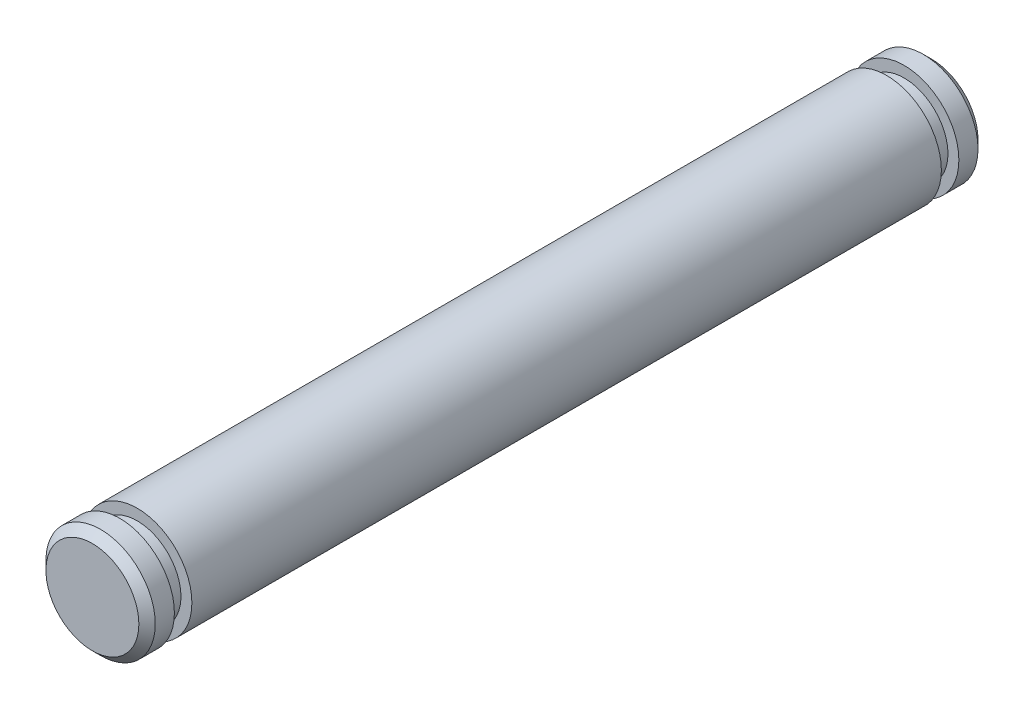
from build123d import *

# Parameters (mm, degrees)
ESQUISSE1_R                = 2
BOSS_EXTRU_1_DEPTH         = 30.7
CHANFREIN1_SIZE            = 0.3
ENL_V_START                = -1.64
ESQUISSE2_R                = 4.744684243
ESQUISSE2_R_2              = 1.6
ENL_V_MAT_EXTRU_1_DEPTH    = 0.64
R_P_TITION_LIN_AIRE1_COUNT = 2
R_P_TITION_LIN_AIRE1_PITCH = 28.06


with BuildPart() as part:
    # Esquisse1 → Boss.-Extru.1 (new body)
    with BuildSketch(Plane.XY):
        Circle(ESQUISSE1_R)
    extrude(amount=BOSS_EXTRU_1_DEPTH)

    # Chanfrein1
    chanfrein1_edges = [part.edges().sort_by_distance(p)[0] for p in [
        (-2, 0, 0),
        (-2, 0, 30.7),
    ]]
    chamfer(chanfrein1_edges, length=CHANFREIN1_SIZE)

    # Esquisse2 → Enl_v. mat.-Extru.1 (cut)
    with BuildSketch(Plane.XY.offset(30.7).offset(ENL_V_START)):
        Circle(ESQUISSE2_R)
        with Locations(Location((0, 0, 0), (0, 0, 180))):
            Circle(ESQUISSE2_R_2, mode=Mode.SUBTRACT)
    enl_v_mat_extru_1 = extrude(amount=ENL_V_MAT_EXTRU_1_DEPTH, mode=Mode.SUBTRACT)

    # R_p_tition lin_aire1: Enl_v. mat.-Extru.1 ×2
    with Locations(*[(0, 0, -i * R_P_TITION_LIN_AIRE1_PITCH) for i in range(1, R_P_TITION_LIN_AIRE1_COUNT)]):
        add(enl_v_mat_extru_1, mode=Mode.SUBTRACT)


solid = part.part
